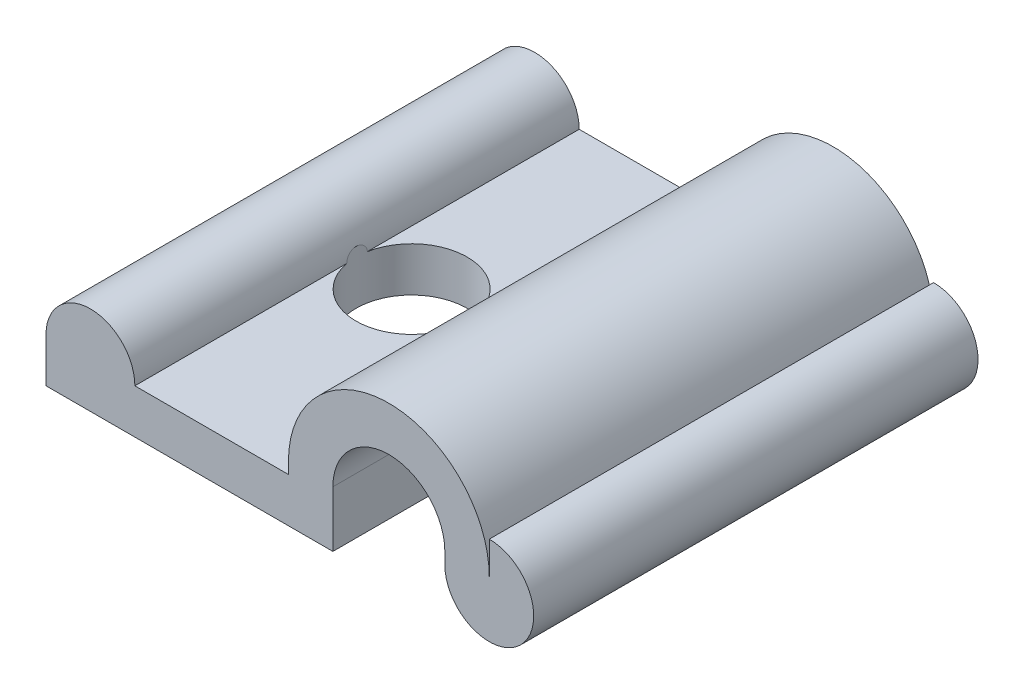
from build123d import *

# Parameters (mm, degrees)
BASE_EXTRUDE_DEPTH = 12.7
SKETCH9_R          = 3.175
CUT_EXTRUDE1_DEPTH = 26.007470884


with BuildPart() as part:
    # Sketch1 → Base-Extrude (new, symmetric)
    with BuildSketch(Plane.XY):
        with BuildLine():
            Line((-14.52, -0.66), (-5.74, -0.66))
            Line((-5.74, -0.66), (-5.74, 0))
            ThreePointArc((-5.74, 0), (0, 5.74), (5.74, 0))
            Line((5.74, 0), (5.74, 1.88))
            ThreePointArc((5.74, 1.88), (7.536051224, -2.456051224), (3.2, -0.66))
            Line((3.2, -0.66), (3.2, 0))
            ThreePointArc((3.2, 0), (0, 3.2), (-3.2, 0))
            Line((-3.2, 0), (-3.2, -3.2))
            Line((-3.2, -3.2), (-19.6, -3.2))
            Line((-19.6, -3.2), (-19.6, -0.66))
            ThreePointArc((-19.6, -0.66), (-17.06, 1.88), (-14.52, -0.66))
        make_face()
    extrude(amount=BASE_EXTRUDE_DEPTH, both=True)

    # Sketch9 → Cut-Extrude1 (cut, through all)
    with BuildSketch(Plane.XZ.offset(3.2)):
        with Locations((-11.4, 0)):
            Circle(SKETCH9_R)
    extrude(amount=-CUT_EXTRUDE1_DEPTH, mode=Mode.SUBTRACT)


solid = part.part
